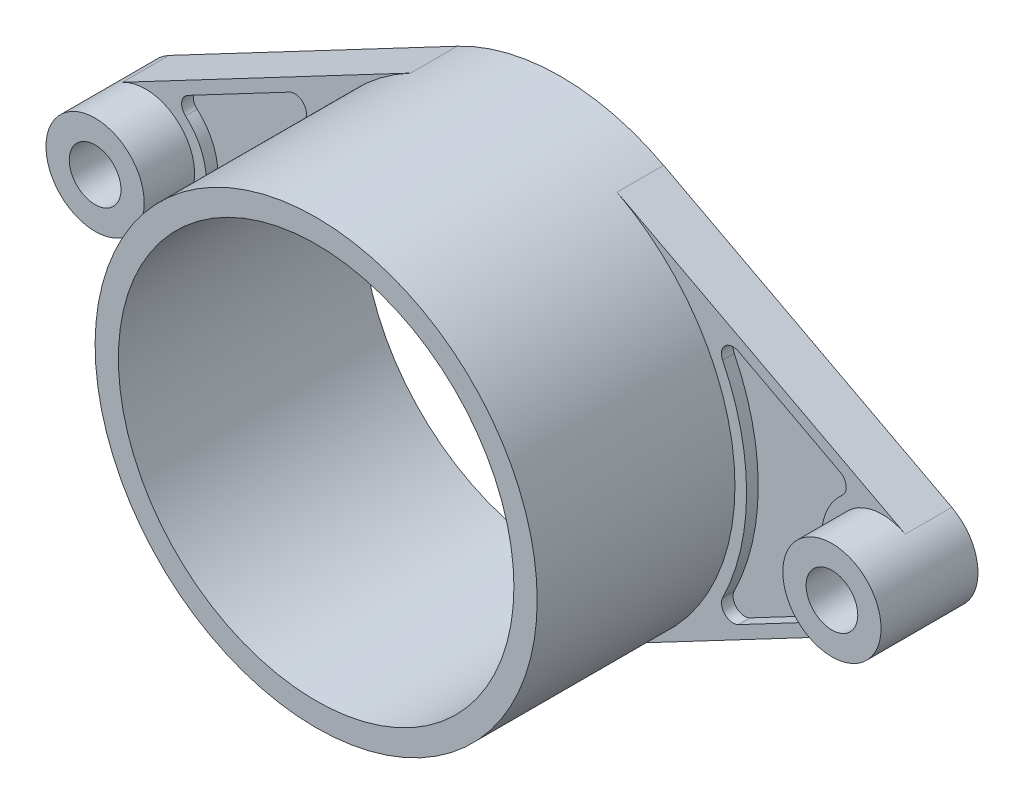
from build123d import *
from build123d.topology import SkipClean

# Parameters (mm, degrees)
SKETCH1_R           = 6.666666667
SKETCH1_R_2         = 51
BOSS_EXTRUDE1_DEPTH = 6
SKETCH2_R           = 12.666666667
SKETCH2_R_2         = 6.666666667
BOSS_EXTRUDE2_DEPTH = 13
BOSS_EXTRUDE3_START = 51
SKETCH3_R           = 57
SKETCH3_R_2         = 51
BOSS_EXTRUDE3_DEPTH = 51
CUT_EXTRUDE1_DEPTH  = 3


with BuildPart() as part:
    # Sketch1 → Boss-Extrude1 (new, symmetric)
    with BuildSketch(Plane.XY):
        with BuildLine():
            Line((26.6, 50.412696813), (100.911111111, 11.202821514))
            ThreePointArc((100.911111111, 11.202821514), (107.666666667, 0), (100.911111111, -11.202821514))
            Line((100.911111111, -11.202821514), (26.6, -50.412696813))
            ThreePointArc((26.6, -50.412696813), (0, -57), (-26.6, -50.412696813))
            Line((-26.6, -50.412696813), (-100.911111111, -11.202821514))
            ThreePointArc((-100.911111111, -11.202821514), (-107.666666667, 0), (-100.911111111, 11.202821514))
            Line((-100.911111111, 11.202821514), (-26.6, 50.412696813))
            ThreePointArc((-26.6, 50.412696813), (0, 57), (26.6, 50.412696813))
        make_face()
        with Locations((-95, 0)):
            Circle(SKETCH1_R, mode=Mode.SUBTRACT)
        with Locations((95, 0)):
            Circle(SKETCH1_R, mode=Mode.SUBTRACT)
        Circle(SKETCH1_R_2, mode=Mode.SUBTRACT)
    extrude(amount=BOSS_EXTRUDE1_DEPTH, both=True)

    # Sketch2 → Boss-Extrude2 (add)
    # profile 1 of 2: a face of its own
    with SkipClean():  # the faces are left unmerged after this step: merging them gives an invalid solid
        with BuildSketch(Plane.XY.offset(6)):
            with Locations(Location((95, 0, 0), (0, 0, 62.181860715))):
                Circle(SKETCH2_R)
            with Locations((95, 0)):
                Circle(SKETCH2_R_2, mode=Mode.SUBTRACT)
        # profile 2 of 2: a face of its own
        with BuildSketch(Plane.XY.offset(6)):
            with Locations(Location((-95, 0, 0), (0, 0, 117.818139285))):
                Circle(SKETCH2_R)
            with Locations((-95, 0)):
                Circle(SKETCH2_R_2, mode=Mode.SUBTRACT)
        extrude(amount=BOSS_EXTRUDE2_DEPTH)

    # Sketch3 → Boss-Extrude3 (add)
    with SkipClean():  # the faces are left unmerged after this step: merging them gives an invalid solid
        with BuildSketch(Plane.XY.offset(6).offset(BOSS_EXTRUDE3_START)):
            with Locations(Location((0, 0, 0), (0, 0, 117.818139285))):
                Circle(SKETCH3_R)
            Circle(SKETCH3_R_2, mode=Mode.SUBTRACT)
        extrude(amount=-BOSS_EXTRUDE3_DEPTH)

    # Sketch4 → Cut-Extrude1 (cut)
    with SkipClean():  # the faces are left unmerged after this step: merging them gives an invalid solid
        with BuildSketch(Plane.XY.offset(6)):
            with BuildLine():
                Line((-57.91207728, 30.499037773), (-84.090489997, 16.686133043))
                ThreePointArc((-84.090489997, 16.686133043), (-85.66988299, 14.383856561), (-84.668804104, 11.777556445))
                ThreePointArc((-84.668804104, 11.777556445), (-79.333333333, 0), (-84.668804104, -11.777556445))
                ThreePointArc((-84.668804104, -11.777556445), (-85.66988299, -14.383856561), (-84.090489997, -16.686133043))
                Line((-84.090489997, -16.686133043), (-57.91207728, -30.499037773))
                ThreePointArc((-57.91207728, -30.499037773), (-54.420335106, -29.996229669), (-53.821025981, -26.51975042))
                ThreePointArc((-53.821025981, -26.51975042), (-60, 0), (-53.821025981, 26.51975042))
                ThreePointArc((-53.821025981, 26.51975042), (-54.420335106, 29.996229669), (-57.91207728, 30.499037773))
            make_face()
            with BuildLine():
                Line((57.91207728, -30.499037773), (84.090489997, -16.686133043))
                ThreePointArc((84.090489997, -16.686133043), (85.66988299, -14.383856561), (84.668804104, -11.777556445))
                ThreePointArc((84.668804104, -11.777556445), (79.333333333, 0), (84.668804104, 11.777556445))
                ThreePointArc((84.668804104, 11.777556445), (85.66988299, 14.383856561), (84.090489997, 16.686133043))
                Line((84.090489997, 16.686133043), (57.91207728, 30.499037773))
                ThreePointArc((57.91207728, 30.499037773), (54.420335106, 29.996229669), (53.821025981, 26.51975042))
                ThreePointArc((53.821025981, 26.51975042), (60, 0), (53.821025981, -26.51975042))
                ThreePointArc((53.821025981, -26.51975042), (54.420335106, -29.996229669), (57.91207728, -30.499037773))
            make_face()
        extrude(amount=-CUT_EXTRUDE1_DEPTH, mode=Mode.SUBTRACT)


solid = part.part
